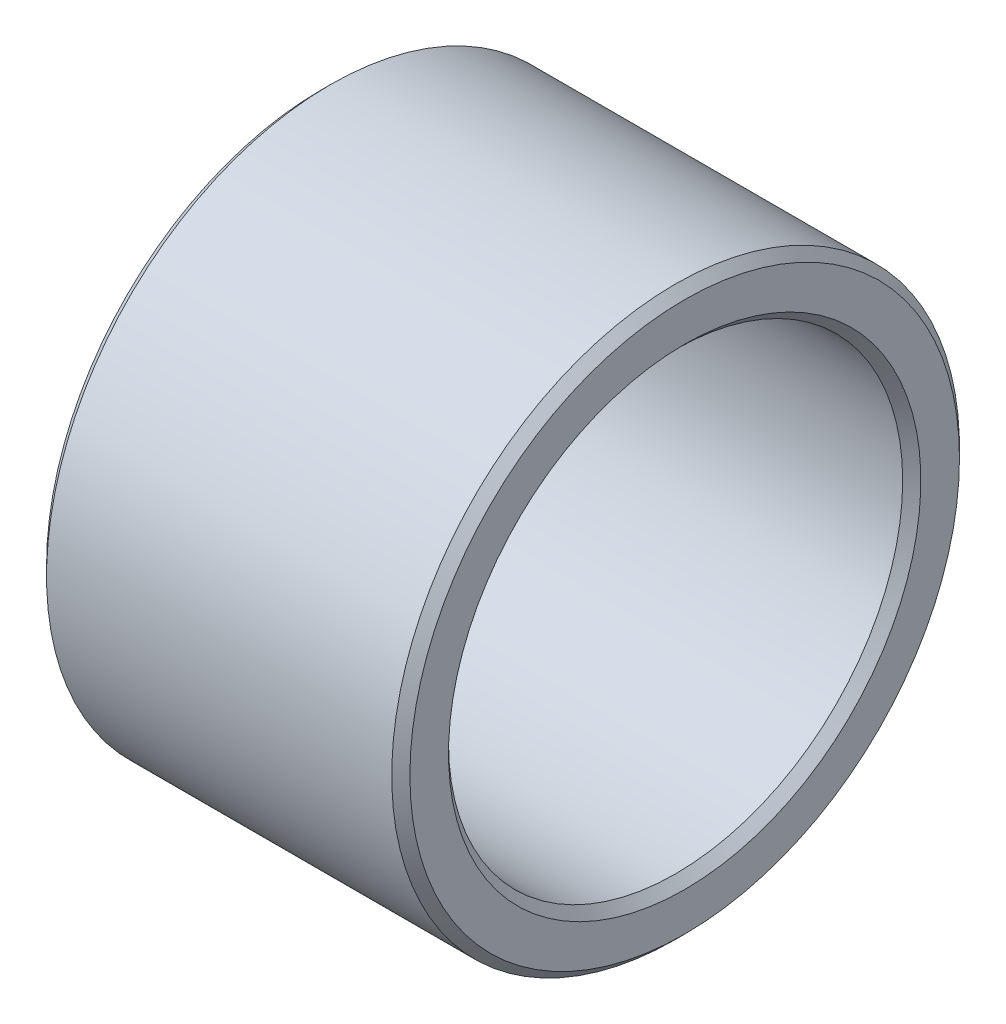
ISO-10303-21;
HEADER;
FILE_DESCRIPTION(('STEP AP214'),'2;1');
FILE_NAME('part.step','',(''),(''),'','','');
FILE_SCHEMA(('AUTOMOTIVE_DESIGN { 1 0 10303 214 1 1 1 1 }'));
ENDSEC;
DATA;
#1=APPLICATION_CONTEXT('core data for automotive mechanical design processes');
#2=APPLICATION_PROTOCOL_DEFINITION('international standard','automotive_design',2000,#1);
#3=PRODUCT_CONTEXT('',#1,'mechanical');
#4=PRODUCT('Part','Part','',(#3));
#5=PRODUCT_RELATED_PRODUCT_CATEGORY('part','',(#4));
#6=PRODUCT_DEFINITION_FORMATION('','',#4);
#7=PRODUCT_DEFINITION_CONTEXT('part definition',#1,'design');
#8=PRODUCT_DEFINITION('design','',#6,#7);
#9=PRODUCT_DEFINITION_SHAPE('','',#8);
#10=(LENGTH_UNIT() NAMED_UNIT(*) SI_UNIT(.MILLI.,.METRE.));
#11=(NAMED_UNIT(*) PLANE_ANGLE_UNIT() SI_UNIT($,.RADIAN.));
#12=(NAMED_UNIT(*) SI_UNIT($,.STERADIAN.) SOLID_ANGLE_UNIT());
#13=UNCERTAINTY_MEASURE_WITH_UNIT(LENGTH_MEASURE(1.E-05),#10,'distance_accuracy_value','');
#14=(GEOMETRIC_REPRESENTATION_CONTEXT(3) GLOBAL_UNCERTAINTY_ASSIGNED_CONTEXT((#13)) GLOBAL_UNIT_ASSIGNED_CONTEXT((#10,
#11,#12)) REPRESENTATION_CONTEXT('',''));
#15=CARTESIAN_POINT('',(0.,0.,0.));
#16=DIRECTION('',(0.,0.,1.));
#17=DIRECTION('',(1.,0.,0.));
#18=AXIS2_PLACEMENT_3D('',#15,#16,#17);
#19=CARTESIAN_POINT('',(0.,-11.25,0.));
#20=DIRECTION('',(-1.,0.,0.));
#21=DIRECTION('',(0.,1.,0.));
#22=AXIS2_PLACEMENT_3D('',#19,#20,#21);
#23=PLANE('',#22);
#24=CARTESIAN_POINT('',(0.,0.,0.));
#25=DIRECTION('',(1.,0.,0.));
#26=DIRECTION('',(0.,-1.,0.));
#27=AXIS2_PLACEMENT_3D('',#24,#25,#26);
#28=CIRCLE('',#27,10.4);
#29=CARTESIAN_POINT('',(0.,-10.4,0.));
#30=VERTEX_POINT('',#29);
#31=EDGE_CURVE('E9',#30,#30,#28,.T.);
#32=ORIENTED_EDGE('',*,*,#31,.T.);
#33=EDGE_LOOP('',(#32));
#34=FACE_BOUND('',#33,.T.);
#35=CARTESIAN_POINT('',(0.,0.,0.));
#36=DIRECTION('',(1.,0.,0.));
#37=DIRECTION('',(0.,-1.,0.));
#38=AXIS2_PLACEMENT_3D('',#35,#36,#37);
#39=CIRCLE('',#38,12.1);
#40=CARTESIAN_POINT('',(0.,-12.1,0.));
#41=VERTEX_POINT('',#40);
#42=EDGE_CURVE('E53',#41,#41,#39,.T.);
#43=ORIENTED_EDGE('',*,*,#42,.F.);
#44=EDGE_LOOP('',(#43));
#45=FACE_BOUND('',#44,.T.);
#46=ADVANCED_FACE('F15',(#34,#45),#23,.T.);
#47=CARTESIAN_POINT('',(0.2,0.,0.));
#48=DIRECTION('',(-1.,0.,0.));
#49=DIRECTION('',(0.,-1.,0.));
#50=AXIS2_PLACEMENT_3D('',#47,#48,#49);
#51=CONICAL_SURFACE('',#50,10.2,0.785398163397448);
#52=CARTESIAN_POINT('',(0.4,0.,0.));
#53=DIRECTION('',(1.,0.,0.));
#54=DIRECTION('',(0.,-1.,0.));
#55=AXIS2_PLACEMENT_3D('',#52,#53,#54);
#56=CIRCLE('',#55,10.);
#57=CARTESIAN_POINT('',(0.4,-10.,0.));
#58=VERTEX_POINT('',#57);
#59=EDGE_CURVE('E22',#58,#58,#56,.T.);
#60=ORIENTED_EDGE('',*,*,#59,.T.);
#61=EDGE_LOOP('',(#60));
#62=FACE_BOUND('',#61,.T.);
#63=ORIENTED_EDGE('',*,*,#31,.F.);
#64=EDGE_LOOP('',(#63));
#65=FACE_BOUND('',#64,.T.);
#66=ADVANCED_FACE('F82',(#62,#65),#51,.F.);
#67=CARTESIAN_POINT('',(8.,0.,0.));
#68=DIRECTION('',(-1.,0.,0.));
#69=DIRECTION('',(0.,-1.,0.));
#70=AXIS2_PLACEMENT_3D('',#67,#68,#69);
#71=CYLINDRICAL_SURFACE('',#70,10.);
#72=CARTESIAN_POINT('',(15.6,0.,0.));
#73=DIRECTION('',(1.,0.,0.));
#74=DIRECTION('',(0.,-1.,0.));
#75=AXIS2_PLACEMENT_3D('',#72,#73,#74);
#76=CIRCLE('',#75,10.);
#77=CARTESIAN_POINT('',(15.6,-10.,0.));
#78=VERTEX_POINT('',#77);
#79=EDGE_CURVE('E58',#78,#78,#76,.T.);
#80=ORIENTED_EDGE('',*,*,#79,.T.);
#81=EDGE_LOOP('',(#80));
#82=FACE_BOUND('',#81,.T.);
#83=ORIENTED_EDGE('',*,*,#59,.F.);
#84=EDGE_LOOP('',(#83));
#85=FACE_BOUND('',#84,.T.);
#86=ADVANCED_FACE('F66',(#82,#85),#71,.F.);
#87=CARTESIAN_POINT('',(15.8,0.,0.));
#88=DIRECTION('',(1.,0.,0.));
#89=DIRECTION('',(0.,-1.,0.));
#90=AXIS2_PLACEMENT_3D('',#87,#88,#89);
#91=CONICAL_SURFACE('',#90,10.2,0.785398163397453);
#92=CARTESIAN_POINT('',(16.,0.,0.));
#93=DIRECTION('',(1.,0.,0.));
#94=DIRECTION('',(0.,-1.,0.));
#95=AXIS2_PLACEMENT_3D('',#92,#93,#94);
#96=CIRCLE('',#95,10.4);
#97=CARTESIAN_POINT('',(16.,-10.4,0.));
#98=VERTEX_POINT('',#97);
#99=EDGE_CURVE('E63',#98,#98,#96,.T.);
#100=ORIENTED_EDGE('',*,*,#99,.T.);
#101=EDGE_LOOP('',(#100));
#102=FACE_BOUND('',#101,.T.);
#103=ORIENTED_EDGE('',*,*,#79,.F.);
#104=EDGE_LOOP('',(#103));
#105=FACE_BOUND('',#104,.T.);
#106=ADVANCED_FACE('F69',(#102,#105),#91,.F.);
#107=CARTESIAN_POINT('',(16.,-11.25,0.));
#108=DIRECTION('',(1.,0.,0.));
#109=DIRECTION('',(0.,-1.,0.));
#110=AXIS2_PLACEMENT_3D('',#107,#108,#109);
#111=PLANE('',#110);
#112=CARTESIAN_POINT('',(16.,0.,0.));
#113=DIRECTION('',(1.,0.,0.));
#114=DIRECTION('',(0.,-1.,0.));
#115=AXIS2_PLACEMENT_3D('',#112,#113,#114);
#116=CIRCLE('',#115,12.1);
#117=CARTESIAN_POINT('',(16.,-12.1,0.));
#118=VERTEX_POINT('',#117);
#119=EDGE_CURVE('E61',#118,#118,#116,.T.);
#120=ORIENTED_EDGE('',*,*,#119,.T.);
#121=EDGE_LOOP('',(#120));
#122=FACE_BOUND('',#121,.T.);
#123=ORIENTED_EDGE('',*,*,#99,.F.);
#124=EDGE_LOOP('',(#123));
#125=FACE_BOUND('',#124,.T.);
#126=ADVANCED_FACE('F71',(#122,#125),#111,.T.);
#127=CARTESIAN_POINT('',(15.8,0.,0.));
#128=DIRECTION('',(-1.,0.,0.));
#129=DIRECTION('',(0.,-1.,0.));
#130=AXIS2_PLACEMENT_3D('',#127,#128,#129);
#131=CONICAL_SURFACE('',#130,12.3,0.785398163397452);
#132=CARTESIAN_POINT('',(15.6,0.,0.));
#133=DIRECTION('',(1.,0.,0.));
#134=DIRECTION('',(0.,-1.,0.));
#135=AXIS2_PLACEMENT_3D('',#132,#133,#134);
#136=CIRCLE('',#135,12.5);
#137=CARTESIAN_POINT('',(15.6,-12.5,0.));
#138=VERTEX_POINT('',#137);
#139=EDGE_CURVE('E55',#138,#138,#136,.T.);
#140=ORIENTED_EDGE('',*,*,#139,.T.);
#141=EDGE_LOOP('',(#140));
#142=FACE_BOUND('',#141,.T.);
#143=ORIENTED_EDGE('',*,*,#119,.F.);
#144=EDGE_LOOP('',(#143));
#145=FACE_BOUND('',#144,.T.);
#146=ADVANCED_FACE('F79',(#142,#145),#131,.T.);
#147=CARTESIAN_POINT('',(8.,0.,0.));
#148=DIRECTION('',(-1.,0.,0.));
#149=DIRECTION('',(0.,-1.,0.));
#150=AXIS2_PLACEMENT_3D('',#147,#148,#149);
#151=CYLINDRICAL_SURFACE('',#150,12.5);
#152=CARTESIAN_POINT('',(0.4,0.,0.));
#153=DIRECTION('',(1.,0.,0.));
#154=DIRECTION('',(0.,-1.,0.));
#155=AXIS2_PLACEMENT_3D('',#152,#153,#154);
#156=CIRCLE('',#155,12.5);
#157=CARTESIAN_POINT('',(0.4,-12.5,0.));
#158=VERTEX_POINT('',#157);
#159=EDGE_CURVE('E49',#158,#158,#156,.T.);
#160=ORIENTED_EDGE('',*,*,#159,.T.);
#161=EDGE_LOOP('',(#160));
#162=FACE_BOUND('',#161,.T.);
#163=ORIENTED_EDGE('',*,*,#139,.F.);
#164=EDGE_LOOP('',(#163));
#165=FACE_BOUND('',#164,.T.);
#166=ADVANCED_FACE('F50',(#162,#165),#151,.T.);
#167=CARTESIAN_POINT('',(0.2,0.,0.));
#168=DIRECTION('',(1.,0.,0.));
#169=DIRECTION('',(0.,-1.,0.));
#170=AXIS2_PLACEMENT_3D('',#167,#168,#169);
#171=CONICAL_SURFACE('',#170,12.3,0.785398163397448);
#172=ORIENTED_EDGE('',*,*,#42,.T.);
#173=EDGE_LOOP('',(#172));
#174=FACE_BOUND('',#173,.T.);
#175=ORIENTED_EDGE('',*,*,#159,.F.);
#176=EDGE_LOOP('',(#175));
#177=FACE_BOUND('',#176,.T.);
#178=ADVANCED_FACE('F92',(#174,#177),#171,.T.);
#179=CLOSED_SHELL('',(#46,#66,#86,#106,#126,#146,#166,#178));
#180=MANIFOLD_SOLID_BREP('B1',#179);
#181=ADVANCED_BREP_SHAPE_REPRESENTATION('',(#18,#180),#14);
#182=SHAPE_DEFINITION_REPRESENTATION(#9,#181);
ENDSEC;
END-ISO-10303-21;
